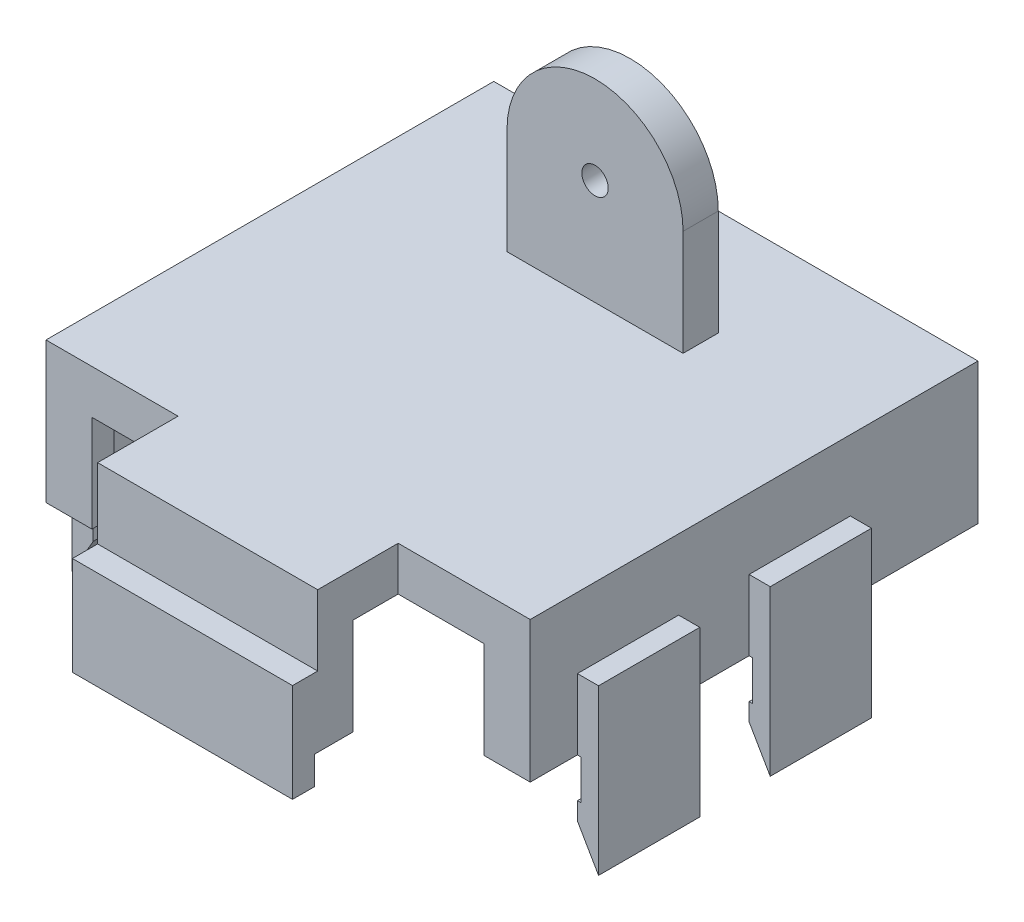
from build123d import *

# Parameters (mm, degrees)
SKETCH2_W               = 55
SKETCH2_H               = 60
BOSS_EXTRUDE1_DEPTH     = 2.5
SKETCH3_W               = 55
SKETCH3_H               = 60
SKETCH3_W_2             = 50
SKETCH3_H_2             = 55
BOSS_EXTRUDE2_DEPTH     = 13.5
SKETCH4_R               = 9.5
CUT_EXTRUDE1_DEPTH      = 2.5
BOSS_EXTRUDE3_DEPTH     = 60
SKETCH7_W               = 2.4
SKETCH7_H               = 14.5
SKETCH7_H_2             = 8
CUT_EXTRUDE2_DEPTH      = 90.712902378
BOSS_EXTRUDE4_DEPTH     = 55
SKETCH12_R              = 1.5
BOSS_EXTRUDE5_DEPTH     = 16
SKETCH13_W              = 12
SKETCH13_H              = 22
CUT_EXTRUDE4_DEPTH      = 79.459820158
CUT_EXTRUDE5_DEPTH      = 93.73793246
CUT_EXTRUDE5_DEPTH_BACK = 93.73793246
SKETCH11_W              = 15
SKETCH11_H              = 12
SKETCH14_W              = 2.5
SKETCH14_H              = 13.5
BOSS_EXTRUDE6_DEPTH     = 15
SKETCH15_W              = 2.5
SKETCH15_H              = 13.5
BOSS_EXTRUDE7_DEPTH     = 6.639634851
SKETCH16_W              = 2.5
SKETCH16_H              = 13.5
BOSS_EXTRUDE9_DEPTH     = 15
SKETCH17_W              = 2.5
SKETCH17_H              = 13.5
BOSS_EXTRUDE10_DEPTH    = 6.639634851
SKETCH18_W              = 44.555575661
SKETCH18_H              = 14.429780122
CUT_EXTRUDE6_DEPTH      = 11


with BuildPart() as part:
    # Sketch2 → Boss-Extrude1 (new body)
    with BuildSketch(Plane(origin=(0, 0, 0), x_dir=(1, 0, 0), z_dir=(0, 1, 0))):
        with Locations((-31.228068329, 32.957790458)):
            Rectangle(SKETCH2_W, SKETCH2_H)
    extrude(amount=BOSS_EXTRUDE1_DEPTH)

    # Sketch3 → Boss-Extrude2 (add)
    with BuildSketch(Plane.XZ):
        with Locations((-31.228068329, -32.957790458)):
            Rectangle(SKETCH3_W, SKETCH3_H)
        with Locations((-31.228068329, -32.957790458)):
            Rectangle(SKETCH3_W_2, SKETCH3_H_2, mode=Mode.SUBTRACT)
    extrude(amount=BOSS_EXTRUDE2_DEPTH)

    # Sketch4 → Cut-Extrude1 (cut)
    with BuildSketch(Plane(origin=(0, 0, -62.957790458), x_dir=(-1, 0, 0), z_dir=(0, 0, -1))):
        with Locations((43.228068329, -13.5)):
            Circle(SKETCH4_R)
        with Locations((17.728068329, -13.5)):
            Circle(SKETCH4_R)
    extrude(amount=-CUT_EXTRUDE1_DEPTH, mode=Mode.SUBTRACT)

    # Sketch6 → Boss-Extrude3 (add)
    with BuildSketch(Plane(origin=(0, 0, -62.957790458), x_dir=(-1, 0, 0), z_dir=(0, 0, -1))):
        Polygon((58.728068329, -5.5), (61.128068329, -5.5), (61.128068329, -24.156921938), (58.728068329, -20), (58.728068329, -18), (59.128068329, -18), (59.128068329, -13.5), (58.728068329, -13.5), align=None)
        Polygon((3.728068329, -20), (1.328068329, -24.156921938), (1.328068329, -5.5), (3.728068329, -5.5), (3.728068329, -13.5), (3.328068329, -13.5), (3.328068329, -18), (3.728068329, -18), align=None)
    extrude(amount=-BOSS_EXTRUDE3_DEPTH)

    # Sketch7 → Cut-Extrude2 (cut, through all)
    with BuildSketch(Plane(origin=(0, -5.5, 0), x_dir=(1, 0, 0), z_dir=(0, 1, 0))):
        with Locations((-59.928068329, 55.707790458)):
            Rectangle(SKETCH7_W, SKETCH7_H)
        with Locations((-59.928068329, 32.957790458)):
            Rectangle(SKETCH7_W, SKETCH7_H_2)
        with Locations((-59.928068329, 10.207790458)):
            Rectangle(SKETCH7_W, SKETCH7_H)
        with Locations((-2.528068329, 10.207790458)):
            Rectangle(SKETCH7_W, SKETCH7_H)
        with Locations((-2.528068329, 32.957790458)):
            Rectangle(SKETCH7_W, SKETCH7_H_2)
        with Locations((-2.528068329, 55.707790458)):
            Rectangle(SKETCH7_W, SKETCH7_H)
    extrude(amount=-CUT_EXTRUDE2_DEPTH, mode=Mode.SUBTRACT)

    # Sketch10 → Boss-Extrude4 (add)
    with BuildSketch(Plane.ZY.offset(58.728068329)):
        Polygon((-2.957790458, -5.5), (-0.097425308, -5.5), (-0.097425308, -16.696671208), (-2.568755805, -16.696671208), (-2.568755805, -13.5), (-2.957790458, -13.5), align=None)
    extrude(amount=-BOSS_EXTRUDE4_DEPTH)

    # Sketch12 → Boss-Extrude5 (add)
    with BuildSketch(Plane(origin=(0, 0, -62.957790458), x_dir=(-1, 0, 0), z_dir=(0, 0, -1))):
        with BuildLine():
            Line((41.228068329, 2.5), (21.228068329, 2.5))
            Line((21.228068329, 2.5), (21.228068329, 14.5))
            ThreePointArc((21.228068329, 14.5), (31.228068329, 24.5), (41.228068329, 14.5))
            Line((41.228068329, 14.5), (41.228068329, 2.5))
        make_face()
        with Locations((31.228068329, 14.5)):
            Circle(SKETCH12_R, mode=Mode.SUBTRACT)
    extrude(amount=-BOSS_EXTRUDE5_DEPTH)

    # Sketch13 → Cut-Extrude4 (cut, through all)
    with BuildSketch(Plane(origin=(-21.228068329, 0, 0), x_dir=(0, 0, -1), z_dir=(1, 0, 0))):
        with Locations((56.957790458, 13.5)):
            Rectangle(SKETCH13_W, SKETCH13_H)
    extrude(amount=-CUT_EXTRUDE4_DEPTH, mode=Mode.SUBTRACT)

    # Sketch11 → Cut-Extrude5 (cut, two sides: drawn at the far end of the back side and taken through both)
    with BuildSketch(Plane(origin=(0, -5.5, 0), x_dir=(1, 0, 0), z_dir=(0, 1, 0)).offset(-CUT_EXTRUDE5_DEPTH_BACK)):
        with Locations((-11.228068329, 6.097425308)):
            Rectangle(SKETCH11_W, SKETCH11_H)
        with Locations((-51.228068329, 6.097425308)):
            Rectangle(SKETCH11_W, SKETCH11_H)
    extrude(amount=CUT_EXTRUDE5_DEPTH + CUT_EXTRUDE5_DEPTH_BACK, mode=Mode.SUBTRACT)

    # Sketch14 → Boss-Extrude6 (add)
    with BuildSketch(Plane(origin=(-56.228068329, 0, 0), x_dir=(0, 0, -1), z_dir=(1, 0, 0))):
        with Locations((13.347425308, -6.75)):
            Rectangle(SKETCH14_W, SKETCH14_H)
    extrude(amount=BOSS_EXTRUDE6_DEPTH)

    # Sketch15 → Boss-Extrude7 (add)
    with BuildSketch(Plane.XY.offset(-12.097425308)):
        with Locations((-42.478068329, -6.75)):
            Rectangle(SKETCH15_W, SKETCH15_H)
    extrude(amount=BOSS_EXTRUDE7_DEPTH)

    # Sketch16 → Boss-Extrude9 (add)
    with BuildSketch(Plane.ZY.offset(6.228068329)):
        with Locations((-13.347425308, -6.75)):
            Rectangle(SKETCH16_W, SKETCH16_H)
    extrude(amount=BOSS_EXTRUDE9_DEPTH)

    # Sketch17 → Boss-Extrude10 (add)
    with BuildSketch(Plane.XY.offset(-12.097425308)):
        with Locations((-19.978068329, -6.75)):
            Rectangle(SKETCH17_W, SKETCH17_H)
    extrude(amount=BOSS_EXTRUDE10_DEPTH)

    # Sketch18 → Cut-Extrude6 (cut)
    with BuildSketch(Plane.XZ.offset(13.5)):
        with Locations((-31.22806833, -14.198124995)):
            Rectangle(SKETCH18_W, SKETCH18_H)
    extrude(amount=-CUT_EXTRUDE6_DEPTH, mode=Mode.SUBTRACT)


solid = part.part
